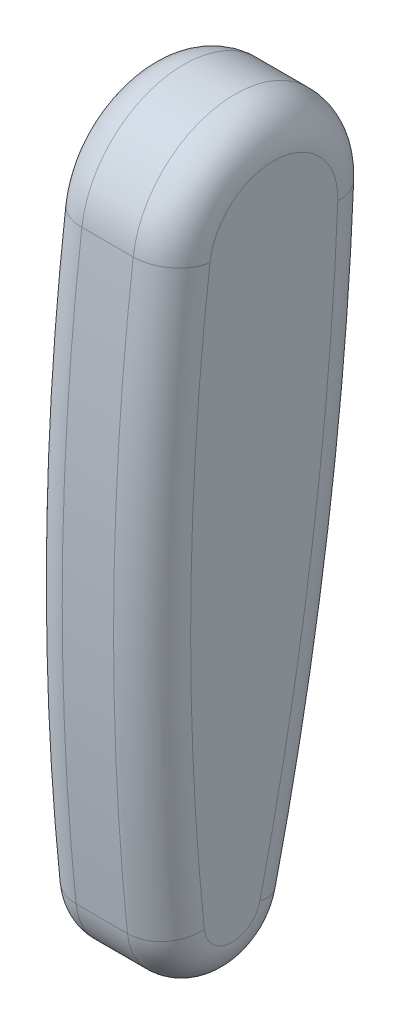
from build123d import *

# Parameters (mm, degrees)
BASE_EXTRUDE_DEPTH = 31.75
FILLET1_R          = 19.05


with BuildPart() as part:
    # Sketch5 → Base-Extrude (new, symmetric)
    with BuildSketch(Plane.ZY.offset(-254)):
        with BuildLine():
            ThreePointArc((9.918396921, -78.230607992), (-44.703978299, -33.86975469), (-91.248408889, -86.643850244))
            ThreePointArc((-91.248408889, -86.643850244), (-78.432247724, -229.591476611), (-52.225916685, -370.69961275))
            ThreePointArc((-52.225916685, -370.69961275), (-17.988619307, -396.10195786), (12.760925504, -366.573375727))
            ThreePointArc((12.760925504, -366.573375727), (19.549821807, -222.321054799), (9.918396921, -78.230607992))
        make_face()
    extrude(amount=BASE_EXTRUDE_DEPTH, both=True)

    # Fillet1
    fillet1_edges = [part.edges().sort_by_distance(p)[0] for p in [
        (222.25, -229.591476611, -78.432247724),
        (222.25, -396.10195786, -17.988619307),
        (222.25, -222.321054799, 19.549821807),
        (285.75, -396.10195786, -17.988619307),
        (285.75, -229.591476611, -78.432247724),
        (285.75, -33.86975469, -44.703978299),
        (285.75, -222.321054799, 19.549821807),
        (222.25, -33.86975469, -44.703978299),
    ]]
    fillet(fillet1_edges, radius=FILLET1_R)


solid = part.part
